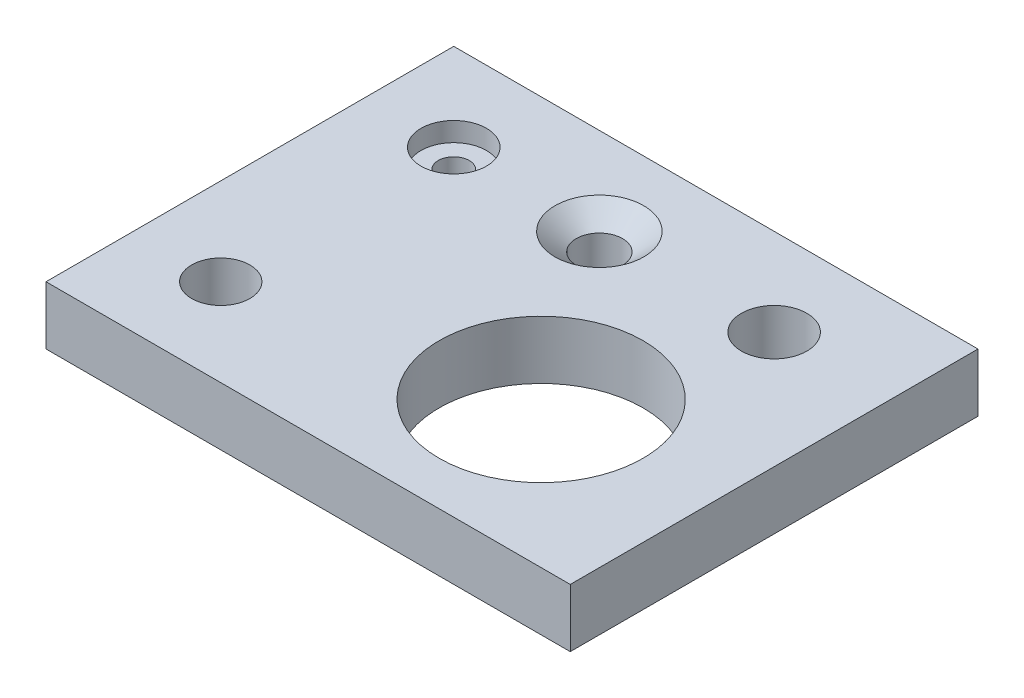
ISO-10303-21;
HEADER;
FILE_DESCRIPTION(('STEP AP214'),'2;1');
FILE_NAME('part.step','',(''),(''),'','','');
FILE_SCHEMA(('AUTOMOTIVE_DESIGN { 1 0 10303 214 1 1 1 1 }'));
ENDSEC;
DATA;
#1=APPLICATION_CONTEXT('core data for automotive mechanical design processes');
#2=APPLICATION_PROTOCOL_DEFINITION('international standard','automotive_design',2000,#1);
#3=PRODUCT_CONTEXT('',#1,'mechanical');
#4=PRODUCT('Part','Part','',(#3));
#5=PRODUCT_RELATED_PRODUCT_CATEGORY('part','',(#4));
#6=PRODUCT_DEFINITION_FORMATION('','',#4);
#7=PRODUCT_DEFINITION_CONTEXT('part definition',#1,'design');
#8=PRODUCT_DEFINITION('design','',#6,#7);
#9=PRODUCT_DEFINITION_SHAPE('','',#8);
#10=(LENGTH_UNIT() NAMED_UNIT(*) SI_UNIT(.MILLI.,.METRE.));
#11=(NAMED_UNIT(*) PLANE_ANGLE_UNIT() SI_UNIT($,.RADIAN.));
#12=(NAMED_UNIT(*) SI_UNIT($,.STERADIAN.) SOLID_ANGLE_UNIT());
#13=UNCERTAINTY_MEASURE_WITH_UNIT(LENGTH_MEASURE(1.E-05),#10,'distance_accuracy_value','');
#14=(GEOMETRIC_REPRESENTATION_CONTEXT(3) GLOBAL_UNCERTAINTY_ASSIGNED_CONTEXT((#13)) GLOBAL_UNIT_ASSIGNED_CONTEXT((#10,
#11,#12)) REPRESENTATION_CONTEXT('',''));
#15=CARTESIAN_POINT('',(0.,0.,0.));
#16=DIRECTION('',(0.,0.,1.));
#17=DIRECTION('',(1.,0.,0.));
#18=AXIS2_PLACEMENT_3D('',#15,#16,#17);
#19=CARTESIAN_POINT('',(-57.15,12.7,-44.45));
#20=DIRECTION('',(1.,0.,0.));
#21=DIRECTION('',(0.,0.,-1.));
#22=AXIS2_PLACEMENT_3D('',#19,#20,#21);
#23=PLANE('',#22);
#24=DIRECTION('',(0.,0.,1.));
#25=VECTOR('',#24,1.);
#26=CARTESIAN_POINT('',(-57.15,0.,-44.45));
#27=LINE('',#26,#25);
#28=CARTESIAN_POINT('',(-57.15,0.,-44.45));
#29=VERTEX_POINT('',#28);
#30=CARTESIAN_POINT('',(-57.15,0.,44.45));
#31=VERTEX_POINT('',#30);
#32=EDGE_CURVE('E77',#29,#31,#27,.T.);
#33=ORIENTED_EDGE('',*,*,#32,.T.);
#34=DIRECTION('',(0.,-1.,0.));
#35=VECTOR('',#34,1.);
#36=CARTESIAN_POINT('',(-57.15,12.7,44.45));
#37=LINE('',#36,#35);
#38=CARTESIAN_POINT('',(-57.15,12.7,44.45));
#39=VERTEX_POINT('',#38);
#40=EDGE_CURVE('E11',#39,#31,#37,.T.);
#41=ORIENTED_EDGE('',*,*,#40,.F.);
#42=DIRECTION('',(0.,0.,1.));
#43=VECTOR('',#42,1.);
#44=CARTESIAN_POINT('',(-57.15,12.7,-44.45));
#45=LINE('',#44,#43);
#46=CARTESIAN_POINT('',(-57.15,12.7,-44.45));
#47=VERTEX_POINT('',#46);
#48=EDGE_CURVE('E100',#47,#39,#45,.T.);
#49=ORIENTED_EDGE('',*,*,#48,.F.);
#50=DIRECTION('',(0.,-1.,0.));
#51=VECTOR('',#50,1.);
#52=CARTESIAN_POINT('',(-57.15,12.7,-44.45));
#53=LINE('',#52,#51);
#54=EDGE_CURVE('E89',#47,#29,#53,.T.);
#55=ORIENTED_EDGE('',*,*,#54,.T.);
#56=EDGE_LOOP('',(#33,#41,#49,#55));
#57=FACE_BOUND('',#56,.T.);
#58=ADVANCED_FACE('F31',(#57),#23,.F.);
#59=CARTESIAN_POINT('',(-57.15,12.7,44.45));
#60=DIRECTION('',(0.,0.,-1.));
#61=DIRECTION('',(-1.,0.,0.));
#62=AXIS2_PLACEMENT_3D('',#59,#60,#61);
#63=PLANE('',#62);
#64=DIRECTION('',(1.,0.,0.));
#65=VECTOR('',#64,1.);
#66=CARTESIAN_POINT('',(-57.15,0.,44.45));
#67=LINE('',#66,#65);
#68=CARTESIAN_POINT('',(57.15,0.,44.45));
#69=VERTEX_POINT('',#68);
#70=EDGE_CURVE('E73',#31,#69,#67,.T.);
#71=ORIENTED_EDGE('',*,*,#70,.T.);
#72=DIRECTION('',(0.,-1.,0.));
#73=VECTOR('',#72,1.);
#74=CARTESIAN_POINT('',(57.15,12.7,44.45));
#75=LINE('',#74,#73);
#76=CARTESIAN_POINT('',(57.15,12.7,44.45));
#77=VERTEX_POINT('',#76);
#78=EDGE_CURVE('E39',#77,#69,#75,.T.);
#79=ORIENTED_EDGE('',*,*,#78,.F.);
#80=DIRECTION('',(1.,0.,0.));
#81=VECTOR('',#80,1.);
#82=CARTESIAN_POINT('',(-57.15,12.7,44.45));
#83=LINE('',#82,#81);
#84=EDGE_CURVE('E85',#39,#77,#83,.T.);
#85=ORIENTED_EDGE('',*,*,#84,.F.);
#86=ORIENTED_EDGE('',*,*,#40,.T.);
#87=EDGE_LOOP('',(#71,#79,#85,#86));
#88=FACE_BOUND('',#87,.T.);
#89=ADVANCED_FACE('F84',(#88),#63,.F.);
#90=CARTESIAN_POINT('',(57.15,12.7,-44.45));
#91=DIRECTION('',(-1.,0.,0.));
#92=DIRECTION('',(0.,0.,1.));
#93=AXIS2_PLACEMENT_3D('',#90,#91,#92);
#94=PLANE('',#93);
#95=DIRECTION('',(0.,0.,-1.));
#96=VECTOR('',#95,1.);
#97=CARTESIAN_POINT('',(57.15,0.,-44.45));
#98=LINE('',#97,#96);
#99=CARTESIAN_POINT('',(57.15,0.,-44.45));
#100=VERTEX_POINT('',#99);
#101=EDGE_CURVE('E78',#69,#100,#98,.T.);
#102=ORIENTED_EDGE('',*,*,#101,.T.);
#103=DIRECTION('',(0.,-1.,0.));
#104=VECTOR('',#103,1.);
#105=CARTESIAN_POINT('',(57.15,12.7,-44.45));
#106=LINE('',#105,#104);
#107=CARTESIAN_POINT('',(57.15,12.7,-44.45));
#108=VERTEX_POINT('',#107);
#109=EDGE_CURVE('E106',#108,#100,#106,.T.);
#110=ORIENTED_EDGE('',*,*,#109,.F.);
#111=DIRECTION('',(0.,0.,-1.));
#112=VECTOR('',#111,1.);
#113=CARTESIAN_POINT('',(57.15,12.7,-44.45));
#114=LINE('',#113,#112);
#115=EDGE_CURVE('E52',#77,#108,#114,.T.);
#116=ORIENTED_EDGE('',*,*,#115,.F.);
#117=ORIENTED_EDGE('',*,*,#78,.T.);
#118=EDGE_LOOP('',(#102,#110,#116,#117));
#119=FACE_BOUND('',#118,.T.);
#120=ADVANCED_FACE('F161',(#119),#94,.F.);
#121=CARTESIAN_POINT('',(-57.15,12.7,-44.45));
#122=DIRECTION('',(0.,0.,1.));
#123=DIRECTION('',(1.,0.,0.));
#124=AXIS2_PLACEMENT_3D('',#121,#122,#123);
#125=PLANE('',#124);
#126=DIRECTION('',(-1.,0.,0.));
#127=VECTOR('',#126,1.);
#128=CARTESIAN_POINT('',(-57.15,0.,-44.45));
#129=LINE('',#128,#127);
#130=EDGE_CURVE('E98',#100,#29,#129,.T.);
#131=ORIENTED_EDGE('',*,*,#130,.T.);
#132=ORIENTED_EDGE('',*,*,#54,.F.);
#133=DIRECTION('',(-1.,0.,0.));
#134=VECTOR('',#133,1.);
#135=CARTESIAN_POINT('',(-57.15,12.7,-44.45));
#136=LINE('',#135,#134);
#137=EDGE_CURVE('E47',#108,#47,#136,.T.);
#138=ORIENTED_EDGE('',*,*,#137,.F.);
#139=ORIENTED_EDGE('',*,*,#109,.T.);
#140=EDGE_LOOP('',(#131,#132,#138,#139));
#141=FACE_BOUND('',#140,.T.);
#142=ADVANCED_FACE('F157',(#141),#125,.F.);
#143=CARTESIAN_POINT('',(-57.15,12.7,44.45));
#144=DIRECTION('',(0.,1.,0.));
#145=DIRECTION('',(0.,0.,1.));
#146=AXIS2_PLACEMENT_3D('',#143,#144,#145);
#147=PLANE('',#146);
#148=CARTESIAN_POINT('',(19.05,12.7,12.7));
#149=DIRECTION('',(0.,1.,0.));
#150=DIRECTION('',(0.,0.,1.));
#151=AXIS2_PLACEMENT_3D('',#148,#149,#150);
#152=CIRCLE('',#151,22.225);
#153=CARTESIAN_POINT('',(19.05,12.7,34.925));
#154=VERTEX_POINT('',#153);
#155=EDGE_CURVE('E253',#154,#154,#152,.T.);
#156=ORIENTED_EDGE('',*,*,#155,.F.);
#157=EDGE_LOOP('',(#156));
#158=FACE_BOUND('',#157,.T.);
#159=CARTESIAN_POINT('',(31.75,12.7,-25.4));
#160=DIRECTION('',(0.,1.,0.));
#161=DIRECTION('',(0.,0.,1.));
#162=AXIS2_PLACEMENT_3D('',#159,#160,#161);
#163=CIRCLE('',#162,7.14375);
#164=CARTESIAN_POINT('',(31.75,12.7,-18.25625));
#165=VERTEX_POINT('',#164);
#166=EDGE_CURVE('E123',#165,#165,#163,.T.);
#167=ORIENTED_EDGE('',*,*,#166,.F.);
#168=EDGE_LOOP('',(#167));
#169=FACE_BOUND('',#168,.T.);
#170=CARTESIAN_POINT('',(-38.1,12.7,25.4));
#171=DIRECTION('',(0.,1.,0.));
#172=DIRECTION('',(0.,0.,1.));
#173=AXIS2_PLACEMENT_3D('',#170,#171,#172);
#174=CIRCLE('',#173,6.34999999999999);
#175=CARTESIAN_POINT('',(-38.1,12.7,31.75));
#176=VERTEX_POINT('',#175);
#177=EDGE_CURVE('E112',#176,#176,#174,.T.);
#178=ORIENTED_EDGE('',*,*,#177,.F.);
#179=EDGE_LOOP('',(#178));
#180=FACE_BOUND('',#179,.T.);
#181=CARTESIAN_POINT('',(-6.35000000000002,12.7,-25.4));
#182=DIRECTION('',(0.,1.,0.));
#183=DIRECTION('',(0.,0.,1.));
#184=AXIS2_PLACEMENT_3D('',#181,#182,#183);
#185=CIRCLE('',#184,9.6774);
#186=CARTESIAN_POINT('',(-6.35000000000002,12.7,-15.7226));
#187=VERTEX_POINT('',#186);
#188=EDGE_CURVE('E129',#187,#187,#185,.T.);
#189=ORIENTED_EDGE('',*,*,#188,.F.);
#190=EDGE_LOOP('',(#189));
#191=FACE_BOUND('',#190,.T.);
#192=CARTESIAN_POINT('',(-38.1,12.7,-25.4));
#193=DIRECTION('',(0.,1.,0.));
#194=DIRECTION('',(0.,0.,1.));
#195=AXIS2_PLACEMENT_3D('',#192,#193,#194);
#196=CIRCLE('',#195,7.14374999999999);
#197=CARTESIAN_POINT('',(-38.1,12.7,-18.25625));
#198=VERTEX_POINT('',#197);
#199=EDGE_CURVE('E132',#198,#198,#196,.T.);
#200=ORIENTED_EDGE('',*,*,#199,.F.);
#201=EDGE_LOOP('',(#200));
#202=FACE_BOUND('',#201,.T.);
#203=ORIENTED_EDGE('',*,*,#48,.T.);
#204=ORIENTED_EDGE('',*,*,#84,.T.);
#205=ORIENTED_EDGE('',*,*,#115,.T.);
#206=ORIENTED_EDGE('',*,*,#137,.T.);
#207=EDGE_LOOP('',(#203,#204,#205,#206));
#208=FACE_BOUND('',#207,.T.);
#209=ADVANCED_FACE('F155',(#158,#169,#180,#191,#202,#208),#147,.T.);
#210=CARTESIAN_POINT('',(-57.15,0.,44.45));
#211=DIRECTION('',(0.,1.,0.));
#212=DIRECTION('',(0.,0.,1.));
#213=AXIS2_PLACEMENT_3D('',#210,#211,#212);
#214=PLANE('',#213);
#215=CARTESIAN_POINT('',(19.05,0.,12.7));
#216=DIRECTION('',(0.,1.,0.));
#217=DIRECTION('',(0.,0.,1.));
#218=AXIS2_PLACEMENT_3D('',#215,#216,#217);
#219=CIRCLE('',#218,22.225);
#220=CARTESIAN_POINT('',(19.05,0.,34.925));
#221=VERTEX_POINT('',#220);
#222=EDGE_CURVE('E250',#221,#221,#219,.T.);
#223=ORIENTED_EDGE('',*,*,#222,.T.);
#224=EDGE_LOOP('',(#223));
#225=FACE_BOUND('',#224,.T.);
#226=CARTESIAN_POINT('',(31.75,0.,-25.4));
#227=DIRECTION('',(0.,1.,0.));
#228=DIRECTION('',(0.,0.,1.));
#229=AXIS2_PLACEMENT_3D('',#226,#227,#228);
#230=CIRCLE('',#229,7.14375);
#231=CARTESIAN_POINT('',(31.75,0.,-18.25625));
#232=VERTEX_POINT('',#231);
#233=EDGE_CURVE('E34',#232,#232,#230,.T.);
#234=ORIENTED_EDGE('',*,*,#233,.T.);
#235=EDGE_LOOP('',(#234));
#236=FACE_BOUND('',#235,.T.);
#237=CARTESIAN_POINT('',(-38.1,0.,25.4));
#238=DIRECTION('',(0.,1.,0.));
#239=DIRECTION('',(0.,0.,1.));
#240=AXIS2_PLACEMENT_3D('',#237,#238,#239);
#241=CIRCLE('',#240,6.34999999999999);
#242=CARTESIAN_POINT('',(-38.1,0.,31.75));
#243=VERTEX_POINT('',#242);
#244=EDGE_CURVE('E109',#243,#243,#241,.T.);
#245=ORIENTED_EDGE('',*,*,#244,.T.);
#246=EDGE_LOOP('',(#245));
#247=FACE_BOUND('',#246,.T.);
#248=CARTESIAN_POINT('',(-6.35000000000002,0.,-25.4));
#249=DIRECTION('',(0.,1.,0.));
#250=DIRECTION('',(0.,0.,1.));
#251=AXIS2_PLACEMENT_3D('',#248,#249,#250);
#252=CIRCLE('',#251,5.0419);
#253=CARTESIAN_POINT('',(-6.35000000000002,0.,-20.3581));
#254=VERTEX_POINT('',#253);
#255=EDGE_CURVE('E111',#254,#254,#252,.T.);
#256=ORIENTED_EDGE('',*,*,#255,.T.);
#257=EDGE_LOOP('',(#256));
#258=FACE_BOUND('',#257,.T.);
#259=CARTESIAN_POINT('',(-38.1,0.,-25.4));
#260=DIRECTION('',(0.,1.,0.));
#261=DIRECTION('',(0.,0.,1.));
#262=AXIS2_PLACEMENT_3D('',#259,#260,#261);
#263=CIRCLE('',#262,3.3782);
#264=CARTESIAN_POINT('',(-38.1,0.,-22.0218));
#265=VERTEX_POINT('',#264);
#266=EDGE_CURVE('E90',#265,#265,#263,.T.);
#267=ORIENTED_EDGE('',*,*,#266,.T.);
#268=EDGE_LOOP('',(#267));
#269=FACE_BOUND('',#268,.T.);
#270=ORIENTED_EDGE('',*,*,#32,.F.);
#271=ORIENTED_EDGE('',*,*,#130,.F.);
#272=ORIENTED_EDGE('',*,*,#101,.F.);
#273=ORIENTED_EDGE('',*,*,#70,.F.);
#274=EDGE_LOOP('',(#270,#271,#272,#273));
#275=FACE_BOUND('',#274,.T.);
#276=ADVANCED_FACE('F74',(#225,#236,#247,#258,#269,#275),#214,.F.);
#277=CARTESIAN_POINT('',(-38.1,12.7,-25.4));
#278=DIRECTION('',(0.,1.,0.));
#279=DIRECTION('',(0.,0.,1.));
#280=AXIS2_PLACEMENT_3D('',#277,#278,#279);
#281=CYLINDRICAL_SURFACE('',#280,3.3782);
#282=ORIENTED_EDGE('',*,*,#266,.F.);
#283=EDGE_LOOP('',(#282));
#284=FACE_BOUND('',#283,.T.);
#285=CARTESIAN_POINT('',(-38.1,8.509,-25.4));
#286=DIRECTION('',(0.,1.,0.));
#287=DIRECTION('',(0.,0.,1.));
#288=AXIS2_PLACEMENT_3D('',#285,#286,#287);
#289=CIRCLE('',#288,3.37820000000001);
#290=CARTESIAN_POINT('',(-38.1,8.509,-22.0218));
#291=VERTEX_POINT('',#290);
#292=EDGE_CURVE('E93',#291,#291,#289,.T.);
#293=ORIENTED_EDGE('',*,*,#292,.T.);
#294=EDGE_LOOP('',(#293));
#295=FACE_BOUND('',#294,.T.);
#296=ADVANCED_FACE('F140',(#284,#295),#281,.F.);
#297=CARTESIAN_POINT('',(-34.7218,8.509,-25.4));
#298=DIRECTION('',(0.,-1.,0.));
#299=DIRECTION('',(0.,0.,-1.));
#300=AXIS2_PLACEMENT_3D('',#297,#298,#299);
#301=PLANE('',#300);
#302=ORIENTED_EDGE('',*,*,#292,.F.);
#303=EDGE_LOOP('',(#302));
#304=FACE_BOUND('',#303,.T.);
#305=CARTESIAN_POINT('',(-38.1,8.509,-25.4));
#306=DIRECTION('',(0.,1.,0.));
#307=DIRECTION('',(0.,0.,1.));
#308=AXIS2_PLACEMENT_3D('',#305,#306,#307);
#309=CIRCLE('',#308,7.14375);
#310=CARTESIAN_POINT('',(-38.1,8.509,-18.25625));
#311=VERTEX_POINT('',#310);
#312=EDGE_CURVE('E135',#311,#311,#309,.T.);
#313=ORIENTED_EDGE('',*,*,#312,.T.);
#314=EDGE_LOOP('',(#313));
#315=FACE_BOUND('',#314,.T.);
#316=ADVANCED_FACE('F142',(#304,#315),#301,.F.);
#317=CARTESIAN_POINT('',(-38.1,12.7,-25.4));
#318=DIRECTION('',(0.,1.,0.));
#319=DIRECTION('',(0.,0.,1.));
#320=AXIS2_PLACEMENT_3D('',#317,#318,#319);
#321=CYLINDRICAL_SURFACE('',#320,7.14375);
#322=ORIENTED_EDGE('',*,*,#312,.F.);
#323=EDGE_LOOP('',(#322));
#324=FACE_BOUND('',#323,.T.);
#325=ORIENTED_EDGE('',*,*,#199,.T.);
#326=EDGE_LOOP('',(#325));
#327=FACE_BOUND('',#326,.T.);
#328=ADVANCED_FACE('F145',(#324,#327),#321,.F.);
#329=CARTESIAN_POINT('',(-6.35000000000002,12.7,-25.4));
#330=DIRECTION('',(0.,1.,0.));
#331=DIRECTION('',(0.,0.,1.));
#332=AXIS2_PLACEMENT_3D('',#329,#330,#331);
#333=CONICAL_SURFACE('',#332,9.6774,0.872664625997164);
#334=CARTESIAN_POINT('',(-6.35000000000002,8.81035365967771,-25.4));
#335=DIRECTION('',(0.,1.,0.));
#336=DIRECTION('',(0.,0.,1.));
#337=AXIS2_PLACEMENT_3D('',#334,#335,#336);
#338=CIRCLE('',#337,5.0419);
#339=CARTESIAN_POINT('',(-6.35000000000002,8.81035365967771,-20.3581));
#340=VERTEX_POINT('',#339);
#341=EDGE_CURVE('E116',#340,#340,#338,.T.);
#342=ORIENTED_EDGE('',*,*,#341,.F.);
#343=EDGE_LOOP('',(#342));
#344=FACE_BOUND('',#343,.T.);
#345=ORIENTED_EDGE('',*,*,#188,.T.);
#346=EDGE_LOOP('',(#345));
#347=FACE_BOUND('',#346,.T.);
#348=ADVANCED_FACE('F151',(#344,#347),#333,.F.);
#349=CARTESIAN_POINT('',(-6.35000000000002,12.7,-25.4));
#350=DIRECTION('',(0.,1.,0.));
#351=DIRECTION('',(0.,0.,1.));
#352=AXIS2_PLACEMENT_3D('',#349,#350,#351);
#353=CYLINDRICAL_SURFACE('',#352,5.0419);
#354=ORIENTED_EDGE('',*,*,#255,.F.);
#355=EDGE_LOOP('',(#354));
#356=FACE_BOUND('',#355,.T.);
#357=ORIENTED_EDGE('',*,*,#341,.T.);
#358=EDGE_LOOP('',(#357));
#359=FACE_BOUND('',#358,.T.);
#360=ADVANCED_FACE('F216',(#356,#359),#353,.F.);
#361=CARTESIAN_POINT('',(-38.1,12.7,25.4));
#362=DIRECTION('',(0.,1.,0.));
#363=DIRECTION('',(0.,0.,1.));
#364=AXIS2_PLACEMENT_3D('',#361,#362,#363);
#365=CYLINDRICAL_SURFACE('',#364,6.34999999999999);
#366=ORIENTED_EDGE('',*,*,#177,.T.);
#367=EDGE_LOOP('',(#366));
#368=FACE_BOUND('',#367,.T.);
#369=ORIENTED_EDGE('',*,*,#244,.F.);
#370=EDGE_LOOP('',(#369));
#371=FACE_BOUND('',#370,.T.);
#372=ADVANCED_FACE('F224',(#368,#371),#365,.F.);
#373=CARTESIAN_POINT('',(31.75,12.7,-25.4));
#374=DIRECTION('',(0.,1.,0.));
#375=DIRECTION('',(0.,0.,1.));
#376=AXIS2_PLACEMENT_3D('',#373,#374,#375);
#377=CYLINDRICAL_SURFACE('',#376,7.14375);
#378=ORIENTED_EDGE('',*,*,#166,.T.);
#379=EDGE_LOOP('',(#378));
#380=FACE_BOUND('',#379,.T.);
#381=ORIENTED_EDGE('',*,*,#233,.F.);
#382=EDGE_LOOP('',(#381));
#383=FACE_BOUND('',#382,.T.);
#384=ADVANCED_FACE('F232',(#380,#383),#377,.F.);
#385=CARTESIAN_POINT('',(19.05,0.,12.7));
#386=DIRECTION('',(0.,1.,0.));
#387=DIRECTION('',(0.,0.,1.));
#388=AXIS2_PLACEMENT_3D('',#385,#386,#387);
#389=CYLINDRICAL_SURFACE('',#388,22.225);
#390=ORIENTED_EDGE('',*,*,#222,.F.);
#391=EDGE_LOOP('',(#390));
#392=FACE_BOUND('',#391,.T.);
#393=ORIENTED_EDGE('',*,*,#155,.T.);
#394=EDGE_LOOP('',(#393));
#395=FACE_BOUND('',#394,.T.);
#396=ADVANCED_FACE('F238',(#392,#395),#389,.F.);
#397=CLOSED_SHELL('',(#58,#89,#120,#142,#209,#276,#296,#316,#328,#348,#360,#372,#384,#396));
#398=MANIFOLD_SOLID_BREP('B2',#397);
#399=ADVANCED_BREP_SHAPE_REPRESENTATION('',(#18,#398),#14);
#400=SHAPE_DEFINITION_REPRESENTATION(#9,#399);
ENDSEC;
END-ISO-10303-21;
